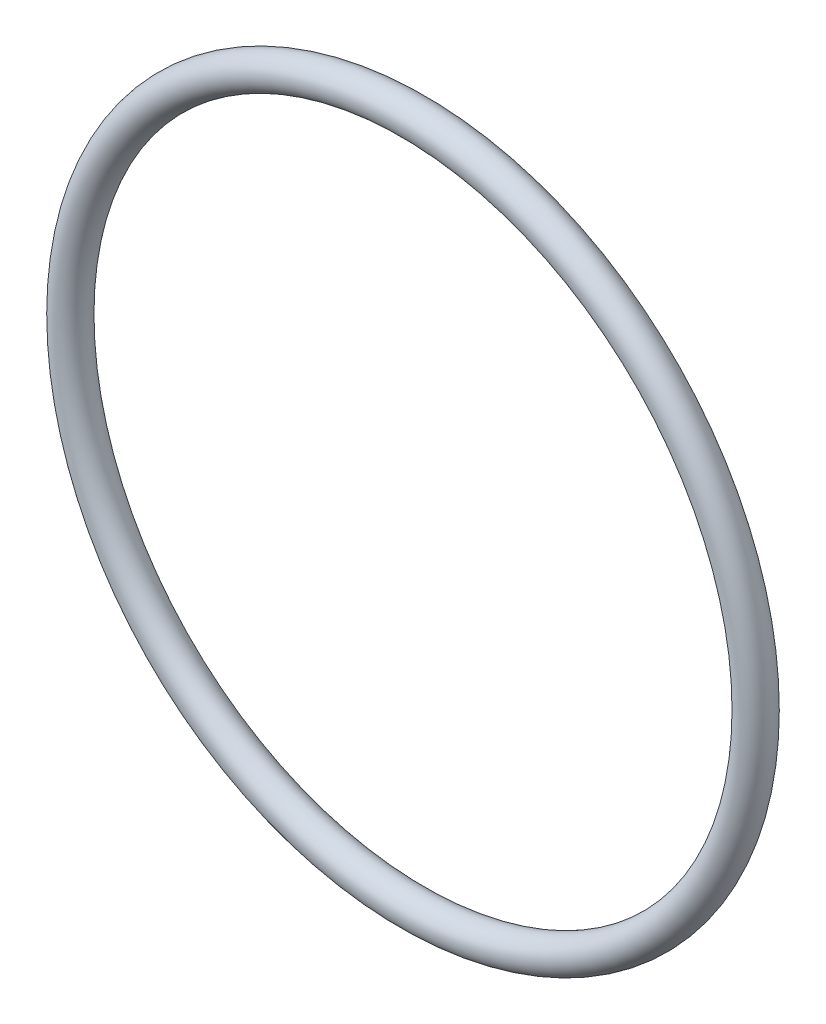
from build123d import *

# Parameters (mm, degrees)
SKETCH1_R = 0.889


with BuildPart() as part:
    # Sketch1 → Revolve1 (revolve)
    with BuildSketch(Plane(origin=(0, 0, 0), x_dir=(0, -1, 0), z_dir=(1, 0, 0)), mode=Mode.PRIVATE) as revolve1_sk:
        with Locations((18.2118, 0)):
            Circle(SKETCH1_R)
    revolve(revolve1_sk.sketch.rotate(Axis((0, 0, 0.889), (0, 0, -1)), 270), axis=Axis((0, 0, 0.889), (0, 0, -1)))


solid = part.part
